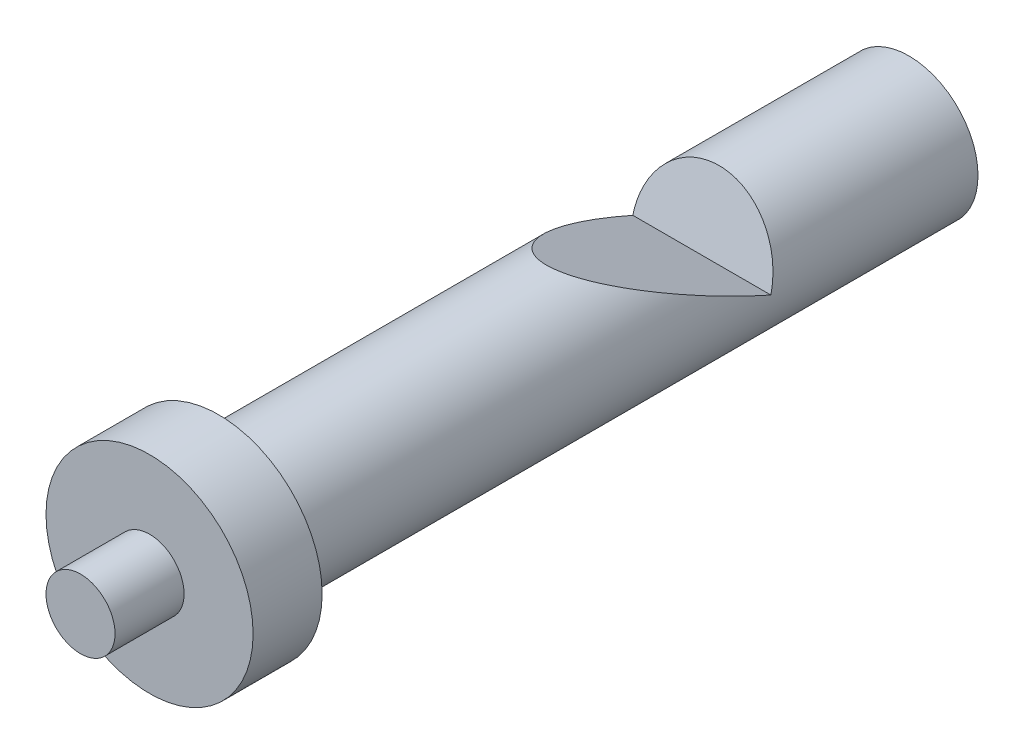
from build123d import *

# Parameters (mm, degrees)
SKETCH_1_R                      = 3
EXTRUDE_1_DEPTH                 = 2
SKETCH_2_R                      = 2
EXTRUDE_2_DEPTH                 = 20
CUT_EXTRUDE_1_REACH             = 44.297
CUT_EXTRUDE_1_DIRECTION_2_REACH = 44.297
SKETCH_4_R                      = 1
EXTRUDE_3_DEPTH                 = 2


with BuildPart() as part:
    # Sketch 1 → Extrude 1 (new body)
    with BuildSketch(Plane.XY):
        with Locations((-7, 33)):
            Circle(SKETCH_1_R)
    extrude(amount=-EXTRUDE_1_DEPTH)

    # Sketch 2 → Extrude 2 (add)
    with BuildSketch(Plane(origin=(0, 0, -2), x_dir=(-1, 0, 0), z_dir=(0, 0, -1))):
        with Locations(Location((7, 33, 0), (0, 0, 180))):
            Circle(SKETCH_2_R)
    extrude(amount=EXTRUDE_2_DEPTH)

    # Sketch 3 → Cut-Extrude 1 (cut, up to next)
    with BuildSketch(Plane(origin=(-7, 0, 0), x_dir=(0, 0, -1), z_dir=(1, 0, 0)), mode=Mode.PRIVATE) as cut_extrude_1_sk1:
        Polygon((16.5, 35), (16, 33), (11.5, 35), align=None)
    cut_extrude_1_tool1 = extrude(cut_extrude_1_sk1.sketch, amount=-CUT_EXTRUDE_1_REACH, mode=Mode.PRIVATE) & part.part
    add(cut_extrude_1_tool1.solids().sort_by_distance((-7, 34.333333, -14.666667))[0], mode=Mode.SUBTRACT)

    # Sketch 3 → Cut-Extrude 1 direction 2 (cut, up to next)
    with BuildSketch(Plane(origin=(-7, 0, 0), x_dir=(0, 0, -1), z_dir=(1, 0, 0)), mode=Mode.PRIVATE) as cut_extrude_1_direction_2_sk1:
        Polygon((16.5, 35), (16, 33), (11.5, 35), align=None)
    cut_extrude_1_direction_2_tool1 = extrude(cut_extrude_1_direction_2_sk1.sketch, amount=CUT_EXTRUDE_1_DIRECTION_2_REACH, mode=Mode.PRIVATE) & part.part
    add(cut_extrude_1_direction_2_tool1.solids().sort_by_distance((-7, 34.333333, -14.666667))[0], mode=Mode.SUBTRACT)

    # Sketch 4 → Extrude 3 (add)
    with BuildSketch(Plane.XY):
        with Locations((-7, 33)):
            Circle(SKETCH_4_R)
    extrude(amount=EXTRUDE_3_DEPTH)


solid = part.part
